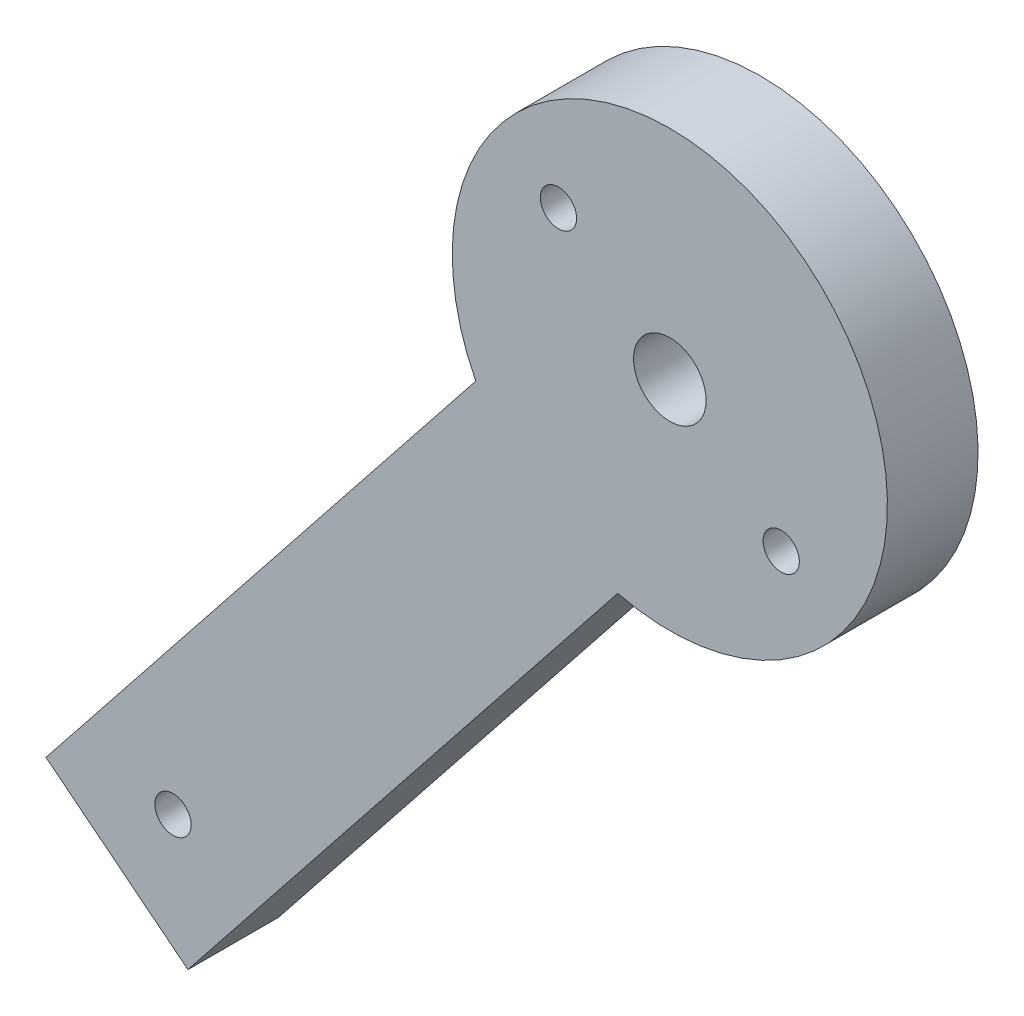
from build123d import *

# Parameters (mm, degrees)
BOSS_EXTRUDE1_DEPTH = 5
SKETCH2_R           = 2
SKETCH2_R_2         = 1
CUT_EXTRUDE1_DEPTH  = 5
SKETCH3_R           = 1
CUT_EXTRUDE2_DEPTH  = 5


with BuildPart() as part:
    # Sketch1 → Boss-Extrude1 (new body)
    with BuildSketch(Plane.XY):
        with BuildLine():
            Line((-10.701790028, -5.428783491), (-34.402726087, -35.248438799))
            Line((-34.402726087, -35.248438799), (-26.574254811, -41.470579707))
            Line((-26.574254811, -41.470579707), (-2.873318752, -11.650924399))
            ThreePointArc((-2.873318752, -11.650924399), (7.46656909, 9.394165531), (-10.701790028, -5.428783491))
        make_face()
    extrude(amount=BOSS_EXTRUDE1_DEPTH)

    # Sketch2 → Cut-Extrude1 (cut)
    with BuildSketch(Plane.XY.offset(5)):
        Circle(SKETCH2_R)
        with Locations((-27.39795306, -34.47110757)):
            Circle(SKETCH2_R_2)
    extrude(amount=-CUT_EXTRUDE1_DEPTH, mode=Mode.SUBTRACT)

    # Sketch3 → Cut-Extrude2 (cut)
    with BuildSketch(Plane.XY.offset(5)):
        with Locations((6.14179704, -5.126239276)):
            Circle(SKETCH3_R)
        with Locations((-6.14179704, 5.126239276)):
            Circle(SKETCH3_R)
    extrude(amount=-CUT_EXTRUDE2_DEPTH, mode=Mode.SUBTRACT)


solid = part.part
